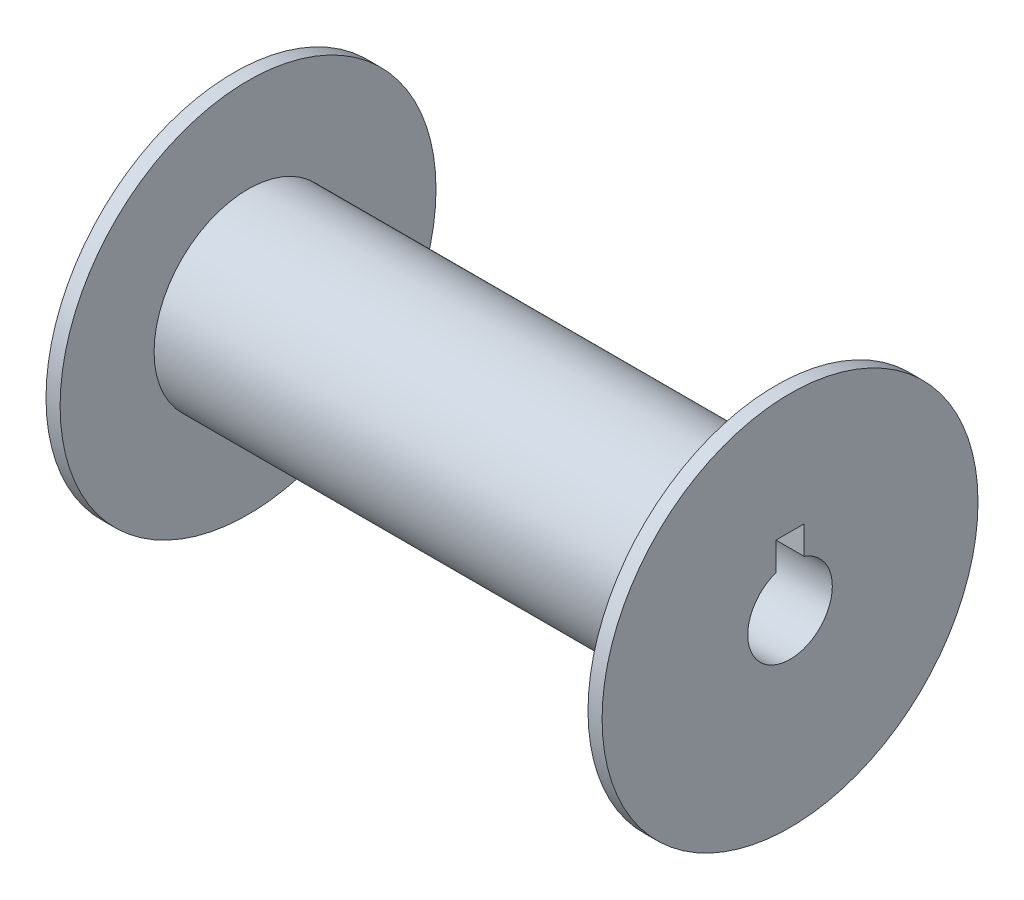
ISO-10303-21;
HEADER;
FILE_DESCRIPTION(('STEP AP214'),'2;1');
FILE_NAME('part.step','',(''),(''),'','','');
FILE_SCHEMA(('AUTOMOTIVE_DESIGN { 1 0 10303 214 1 1 1 1 }'));
ENDSEC;
DATA;
#1=APPLICATION_CONTEXT('core data for automotive mechanical design processes');
#2=APPLICATION_PROTOCOL_DEFINITION('international standard','automotive_design',2000,#1);
#3=PRODUCT_CONTEXT('',#1,'mechanical');
#4=PRODUCT('Part','Part','',(#3));
#5=PRODUCT_RELATED_PRODUCT_CATEGORY('part','',(#4));
#6=PRODUCT_DEFINITION_FORMATION('','',#4);
#7=PRODUCT_DEFINITION_CONTEXT('part definition',#1,'design');
#8=PRODUCT_DEFINITION('design','',#6,#7);
#9=PRODUCT_DEFINITION_SHAPE('','',#8);
#10=(LENGTH_UNIT() NAMED_UNIT(*) SI_UNIT(.MILLI.,.METRE.));
#11=(NAMED_UNIT(*) PLANE_ANGLE_UNIT() SI_UNIT($,.RADIAN.));
#12=(NAMED_UNIT(*) SI_UNIT($,.STERADIAN.) SOLID_ANGLE_UNIT());
#13=UNCERTAINTY_MEASURE_WITH_UNIT(LENGTH_MEASURE(1.E-05),#10,'distance_accuracy_value','');
#14=(GEOMETRIC_REPRESENTATION_CONTEXT(3) GLOBAL_UNCERTAINTY_ASSIGNED_CONTEXT((#13)) GLOBAL_UNIT_ASSIGNED_CONTEXT((#10,
#11,#12)) REPRESENTATION_CONTEXT('',''));
#15=CARTESIAN_POINT('',(0.,0.,0.));
#16=DIRECTION('',(0.,0.,1.));
#17=DIRECTION('',(1.,0.,0.));
#18=AXIS2_PLACEMENT_3D('',#15,#16,#17);
#19=CARTESIAN_POINT('',(118.35,0.,0.));
#20=DIRECTION('',(-1.,0.,0.));
#21=DIRECTION('',(0.,0.,1.));
#22=AXIS2_PLACEMENT_3D('',#19,#20,#21);
#23=CYLINDRICAL_SURFACE('',#22,40.);
#24=CARTESIAN_POINT('',(0.,0.,0.));
#25=DIRECTION('',(1.,0.,0.));
#26=DIRECTION('',(0.,0.,-1.));
#27=AXIS2_PLACEMENT_3D('',#24,#25,#26);
#28=CIRCLE('',#27,40.);
#29=CARTESIAN_POINT('',(0.,0.,-40.));
#30=VERTEX_POINT('',#29);
#31=EDGE_CURVE('E36',#30,#30,#28,.T.);
#32=ORIENTED_EDGE('',*,*,#31,.T.);
#33=EDGE_LOOP('',(#32));
#34=FACE_BOUND('',#33,.T.);
#35=CARTESIAN_POINT('',(2.99999999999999,0.,0.));
#36=DIRECTION('',(-1.,0.,0.));
#37=DIRECTION('',(0.,0.,1.));
#38=AXIS2_PLACEMENT_3D('',#35,#36,#37);
#39=CIRCLE('',#38,40.);
#40=CARTESIAN_POINT('',(2.99999999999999,0.,40.));
#41=VERTEX_POINT('',#40);
#42=EDGE_CURVE('E139',#41,#41,#39,.T.);
#43=ORIENTED_EDGE('',*,*,#42,.T.);
#44=EDGE_LOOP('',(#43));
#45=FACE_BOUND('',#44,.T.);
#46=ADVANCED_FACE('F33',(#34,#45),#23,.T.);
#47=CARTESIAN_POINT('',(118.35,0.,0.));
#48=DIRECTION('',(1.,0.,0.));
#49=DIRECTION('',(0.,0.,-1.));
#50=AXIS2_PLACEMENT_3D('',#47,#48,#49);
#51=CIRCLE('',#50,40.);
#52=CARTESIAN_POINT('',(118.35,0.,-40.));
#53=VERTEX_POINT('',#52);
#54=EDGE_CURVE('E11',#53,#53,#51,.T.);
#55=ORIENTED_EDGE('',*,*,#54,.F.);
#56=EDGE_LOOP('',(#55));
#57=FACE_BOUND('',#56,.T.);
#58=CARTESIAN_POINT('',(115.35,0.,0.));
#59=DIRECTION('',(-1.,0.,0.));
#60=DIRECTION('',(0.,0.,1.));
#61=AXIS2_PLACEMENT_3D('',#58,#59,#60);
#62=CIRCLE('',#61,40.);
#63=CARTESIAN_POINT('',(115.35,0.,40.));
#64=VERTEX_POINT('',#63);
#65=EDGE_CURVE('E141',#64,#64,#62,.T.);
#66=ORIENTED_EDGE('',*,*,#65,.F.);
#67=EDGE_LOOP('',(#66));
#68=FACE_BOUND('',#67,.T.);
#69=ADVANCED_FACE('F128',(#57,#68),#23,.T.);
#70=CARTESIAN_POINT('',(118.35,0.,0.));
#71=DIRECTION('',(1.,0.,0.));
#72=DIRECTION('',(0.,0.,-1.));
#73=AXIS2_PLACEMENT_3D('',#70,#71,#72);
#74=PLANE('',#73);
#75=ORIENTED_EDGE('',*,*,#54,.T.);
#76=EDGE_LOOP('',(#75));
#77=FACE_BOUND('',#76,.T.);
#78=DIRECTION('',(0.,1.,0.));
#79=VECTOR('',#78,1.);
#80=CARTESIAN_POINT('',(118.35,8.48528137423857,-3.));
#81=LINE('',#80,#79);
#82=CARTESIAN_POINT('',(118.35,8.48528137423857,-3.));
#83=VERTEX_POINT('',#82);
#84=CARTESIAN_POINT('',(118.35,14.4852813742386,-3.));
#85=VERTEX_POINT('',#84);
#86=EDGE_CURVE('E81',#83,#85,#81,.T.);
#87=ORIENTED_EDGE('',*,*,#86,.F.);
#88=CARTESIAN_POINT('',(118.35,0.,0.));
#89=DIRECTION('',(1.,0.,0.));
#90=DIRECTION('',(0.,0.,-1.));
#91=AXIS2_PLACEMENT_3D('',#88,#89,#90);
#92=CIRCLE('',#91,9.);
#93=CARTESIAN_POINT('',(118.35,8.48528137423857,3.));
#94=VERTEX_POINT('',#93);
#95=EDGE_CURVE('E73',#94,#83,#92,.T.);
#96=ORIENTED_EDGE('',*,*,#95,.F.);
#97=DIRECTION('',(0.,-1.,0.));
#98=VECTOR('',#97,1.);
#99=CARTESIAN_POINT('',(118.35,8.48528137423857,3.));
#100=LINE('',#99,#98);
#101=CARTESIAN_POINT('',(118.35,14.4852813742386,3.));
#102=VERTEX_POINT('',#101);
#103=EDGE_CURVE('E95',#102,#94,#100,.T.);
#104=ORIENTED_EDGE('',*,*,#103,.F.);
#105=DIRECTION('',(0.,0.,1.));
#106=VECTOR('',#105,1.);
#107=CARTESIAN_POINT('',(118.35,14.4852813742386,3.));
#108=LINE('',#107,#106);
#109=EDGE_CURVE('E93',#85,#102,#108,.T.);
#110=ORIENTED_EDGE('',*,*,#109,.F.);
#111=EDGE_LOOP('',(#87,#96,#104,#110));
#112=FACE_BOUND('',#111,.T.);
#113=ADVANCED_FACE('F92',(#77,#112),#74,.T.);
#114=CARTESIAN_POINT('',(0.,0.,0.));
#115=DIRECTION('',(1.,0.,0.));
#116=DIRECTION('',(0.,0.,-1.));
#117=AXIS2_PLACEMENT_3D('',#114,#115,#116);
#118=PLANE('',#117);
#119=ORIENTED_EDGE('',*,*,#31,.F.);
#120=EDGE_LOOP('',(#119));
#121=FACE_BOUND('',#120,.T.);
#122=CARTESIAN_POINT('',(0.,0.,0.));
#123=DIRECTION('',(1.,0.,0.));
#124=DIRECTION('',(0.,0.,-1.));
#125=AXIS2_PLACEMENT_3D('',#122,#123,#124);
#126=CIRCLE('',#125,9.);
#127=CARTESIAN_POINT('',(0.,8.48528137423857,3.));
#128=VERTEX_POINT('',#127);
#129=CARTESIAN_POINT('',(0.,8.48528137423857,-3.));
#130=VERTEX_POINT('',#129);
#131=EDGE_CURVE('E55',#128,#130,#126,.T.);
#132=ORIENTED_EDGE('',*,*,#131,.T.);
#133=DIRECTION('',(0.,1.,0.));
#134=VECTOR('',#133,1.);
#135=CARTESIAN_POINT('',(0.,8.48528137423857,-3.));
#136=LINE('',#135,#134);
#137=CARTESIAN_POINT('',(0.,14.4852813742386,-3.));
#138=VERTEX_POINT('',#137);
#139=EDGE_CURVE('E88',#130,#138,#136,.T.);
#140=ORIENTED_EDGE('',*,*,#139,.T.);
#141=DIRECTION('',(0.,0.,1.));
#142=VECTOR('',#141,1.);
#143=CARTESIAN_POINT('',(0.,14.4852813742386,3.));
#144=LINE('',#143,#142);
#145=CARTESIAN_POINT('',(0.,14.4852813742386,3.));
#146=VERTEX_POINT('',#145);
#147=EDGE_CURVE('E103',#138,#146,#144,.T.);
#148=ORIENTED_EDGE('',*,*,#147,.T.);
#149=DIRECTION('',(0.,-1.,0.));
#150=VECTOR('',#149,1.);
#151=CARTESIAN_POINT('',(0.,8.48528137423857,3.));
#152=LINE('',#151,#150);
#153=EDGE_CURVE('E82',#146,#128,#152,.T.);
#154=ORIENTED_EDGE('',*,*,#153,.T.);
#155=EDGE_LOOP('',(#132,#140,#148,#154));
#156=FACE_BOUND('',#155,.T.);
#157=ADVANCED_FACE('F114',(#121,#156),#118,.F.);
#158=CARTESIAN_POINT('',(118.35,0.,0.));
#159=DIRECTION('',(-1.,0.,0.));
#160=DIRECTION('',(0.,0.,1.));
#161=AXIS2_PLACEMENT_3D('',#158,#159,#160);
#162=CYLINDRICAL_SURFACE('',#161,9.);
#163=ORIENTED_EDGE('',*,*,#131,.F.);
#164=DIRECTION('',(-1.,0.,0.));
#165=VECTOR('',#164,1.);
#166=CARTESIAN_POINT('',(118.35,8.48528137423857,3.));
#167=LINE('',#166,#165);
#168=EDGE_CURVE('E77',#94,#128,#167,.T.);
#169=ORIENTED_EDGE('',*,*,#168,.F.);
#170=ORIENTED_EDGE('',*,*,#95,.T.);
#171=DIRECTION('',(-1.,0.,0.));
#172=VECTOR('',#171,1.);
#173=CARTESIAN_POINT('',(118.35,8.48528137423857,-3.));
#174=LINE('',#173,#172);
#175=EDGE_CURVE('E76',#83,#130,#174,.T.);
#176=ORIENTED_EDGE('',*,*,#175,.T.);
#177=EDGE_LOOP('',(#163,#169,#170,#176));
#178=FACE_BOUND('',#177,.T.);
#179=ADVANCED_FACE('F75',(#178),#162,.F.);
#180=CARTESIAN_POINT('',(118.35,8.48528137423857,-3.));
#181=DIRECTION('',(0.,0.,1.));
#182=DIRECTION('',(1.,0.,0.));
#183=AXIS2_PLACEMENT_3D('',#180,#181,#182);
#184=PLANE('',#183);
#185=ORIENTED_EDGE('',*,*,#139,.F.);
#186=ORIENTED_EDGE('',*,*,#175,.F.);
#187=ORIENTED_EDGE('',*,*,#86,.T.);
#188=DIRECTION('',(-1.,0.,0.));
#189=VECTOR('',#188,1.);
#190=CARTESIAN_POINT('',(118.35,14.4852813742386,-3.));
#191=LINE('',#190,#189);
#192=EDGE_CURVE('E89',#85,#138,#191,.T.);
#193=ORIENTED_EDGE('',*,*,#192,.T.);
#194=EDGE_LOOP('',(#185,#186,#187,#193));
#195=FACE_BOUND('',#194,.T.);
#196=ADVANCED_FACE('F85',(#195),#184,.T.);
#197=CARTESIAN_POINT('',(118.35,14.4852813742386,3.));
#198=DIRECTION('',(0.,-1.,0.));
#199=DIRECTION('',(0.,0.,-1.));
#200=AXIS2_PLACEMENT_3D('',#197,#198,#199);
#201=PLANE('',#200);
#202=ORIENTED_EDGE('',*,*,#147,.F.);
#203=ORIENTED_EDGE('',*,*,#192,.F.);
#204=ORIENTED_EDGE('',*,*,#109,.T.);
#205=DIRECTION('',(-1.,0.,0.));
#206=VECTOR('',#205,1.);
#207=CARTESIAN_POINT('',(118.35,14.4852813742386,3.));
#208=LINE('',#207,#206);
#209=EDGE_CURVE('E47',#102,#146,#208,.T.);
#210=ORIENTED_EDGE('',*,*,#209,.T.);
#211=EDGE_LOOP('',(#202,#203,#204,#210));
#212=FACE_BOUND('',#211,.T.);
#213=ADVANCED_FACE('F112',(#212),#201,.T.);
#214=CARTESIAN_POINT('',(118.35,8.48528137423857,3.));
#215=DIRECTION('',(0.,0.,-1.));
#216=DIRECTION('',(-1.,0.,0.));
#217=AXIS2_PLACEMENT_3D('',#214,#215,#216);
#218=PLANE('',#217);
#219=ORIENTED_EDGE('',*,*,#153,.F.);
#220=ORIENTED_EDGE('',*,*,#209,.F.);
#221=ORIENTED_EDGE('',*,*,#103,.T.);
#222=ORIENTED_EDGE('',*,*,#168,.T.);
#223=EDGE_LOOP('',(#219,#220,#221,#222));
#224=FACE_BOUND('',#223,.T.);
#225=ADVANCED_FACE('F115',(#224),#218,.T.);
#226=CARTESIAN_POINT('',(2.99999999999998,0.,-40.));
#227=DIRECTION('',(1.,0.,0.));
#228=DIRECTION('',(0.,0.,-1.));
#229=AXIS2_PLACEMENT_3D('',#226,#227,#228);
#230=PLANE('',#229);
#231=CARTESIAN_POINT('',(2.99999999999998,0.,0.));
#232=DIRECTION('',(-1.,0.,0.));
#233=DIRECTION('',(0.,0.,1.));
#234=AXIS2_PLACEMENT_3D('',#231,#232,#233);
#235=CIRCLE('',#234,20.);
#236=CARTESIAN_POINT('',(2.99999999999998,0.,20.));
#237=VERTEX_POINT('',#236);
#238=EDGE_CURVE('E101',#237,#237,#235,.T.);
#239=ORIENTED_EDGE('',*,*,#238,.T.);
#240=EDGE_LOOP('',(#239));
#241=FACE_BOUND('',#240,.T.);
#242=ORIENTED_EDGE('',*,*,#42,.F.);
#243=EDGE_LOOP('',(#242));
#244=FACE_BOUND('',#243,.T.);
#245=ADVANCED_FACE('F117',(#241,#244),#230,.T.);
#246=CARTESIAN_POINT('',(0.,0.,0.));
#247=DIRECTION('',(-1.,0.,0.));
#248=DIRECTION('',(0.,0.,1.));
#249=AXIS2_PLACEMENT_3D('',#246,#247,#248);
#250=CYLINDRICAL_SURFACE('',#249,20.);
#251=CARTESIAN_POINT('',(115.35,0.,0.));
#252=DIRECTION('',(-1.,0.,0.));
#253=DIRECTION('',(0.,0.,1.));
#254=AXIS2_PLACEMENT_3D('',#251,#252,#253);
#255=CIRCLE('',#254,20.);
#256=CARTESIAN_POINT('',(115.35,0.,20.));
#257=VERTEX_POINT('',#256);
#258=EDGE_CURVE('E144',#257,#257,#255,.T.);
#259=ORIENTED_EDGE('',*,*,#258,.T.);
#260=EDGE_LOOP('',(#259));
#261=FACE_BOUND('',#260,.T.);
#262=ORIENTED_EDGE('',*,*,#238,.F.);
#263=EDGE_LOOP('',(#262));
#264=FACE_BOUND('',#263,.T.);
#265=ADVANCED_FACE('F123',(#261,#264),#250,.T.);
#266=CARTESIAN_POINT('',(115.35,0.,-40.));
#267=DIRECTION('',(-1.,0.,0.));
#268=DIRECTION('',(0.,0.,1.));
#269=AXIS2_PLACEMENT_3D('',#266,#267,#268);
#270=PLANE('',#269);
#271=ORIENTED_EDGE('',*,*,#65,.T.);
#272=EDGE_LOOP('',(#271));
#273=FACE_BOUND('',#272,.T.);
#274=ORIENTED_EDGE('',*,*,#258,.F.);
#275=EDGE_LOOP('',(#274));
#276=FACE_BOUND('',#275,.T.);
#277=ADVANCED_FACE('F152',(#273,#276),#270,.T.);
#278=CLOSED_SHELL('',(#46,#69,#113,#157,#179,#196,#213,#225,#245,#265,#277));
#279=MANIFOLD_SOLID_BREP('B2',#278);
#280=ADVANCED_BREP_SHAPE_REPRESENTATION('',(#18,#279),#14);
#281=SHAPE_DEFINITION_REPRESENTATION(#9,#280);
ENDSEC;
END-ISO-10303-21;
